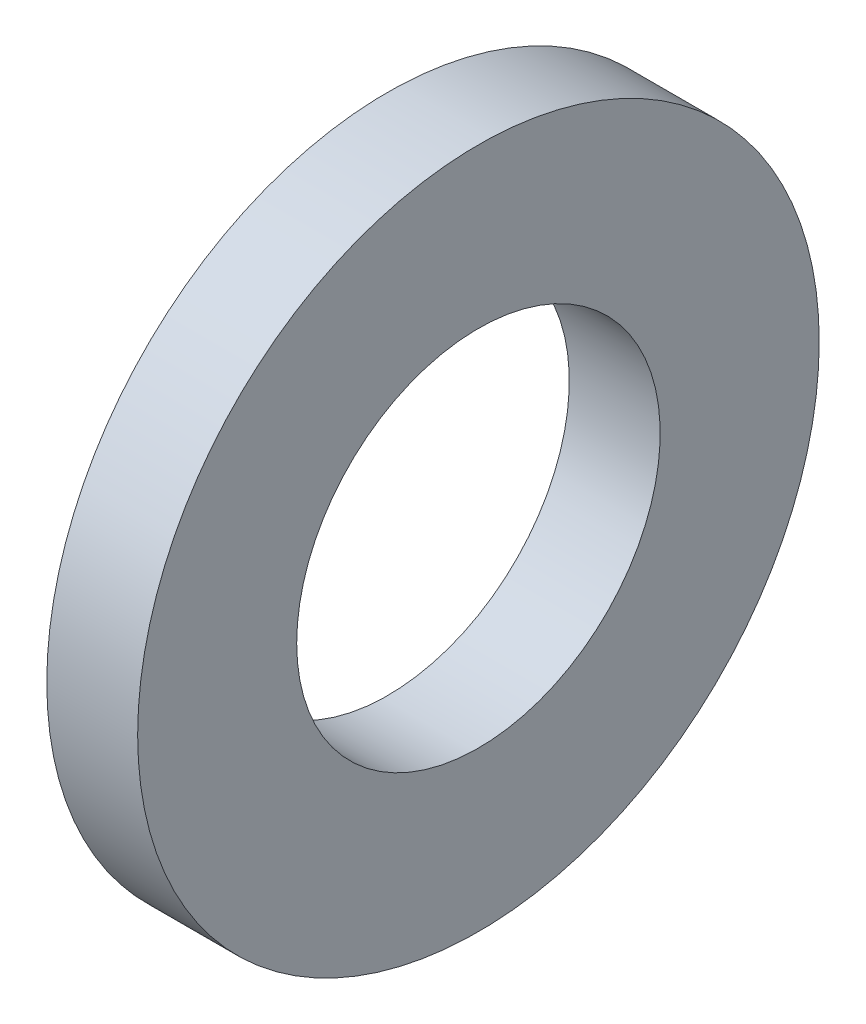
from build123d import *

# Parameters (mm, degrees)
SKETCH1_W = 1.6
SKETCH1_H = 2.8


with BuildPart() as part:
    # Sketch1 → Base-Revolve (revolve)
    with BuildSketch(Plane.XY, mode=Mode.PRIVATE) as base_revolve_sk:
        with Locations((-0.8, 4.6)):
            Rectangle(SKETCH1_W, SKETCH1_H)
    revolve(base_revolve_sk.sketch.rotate(Axis((-34.925, 0, 0), (1, 0, 0)), 90), axis=Axis((-34.925, 0, 0), (1, 0, 0)))


solid = part.part
